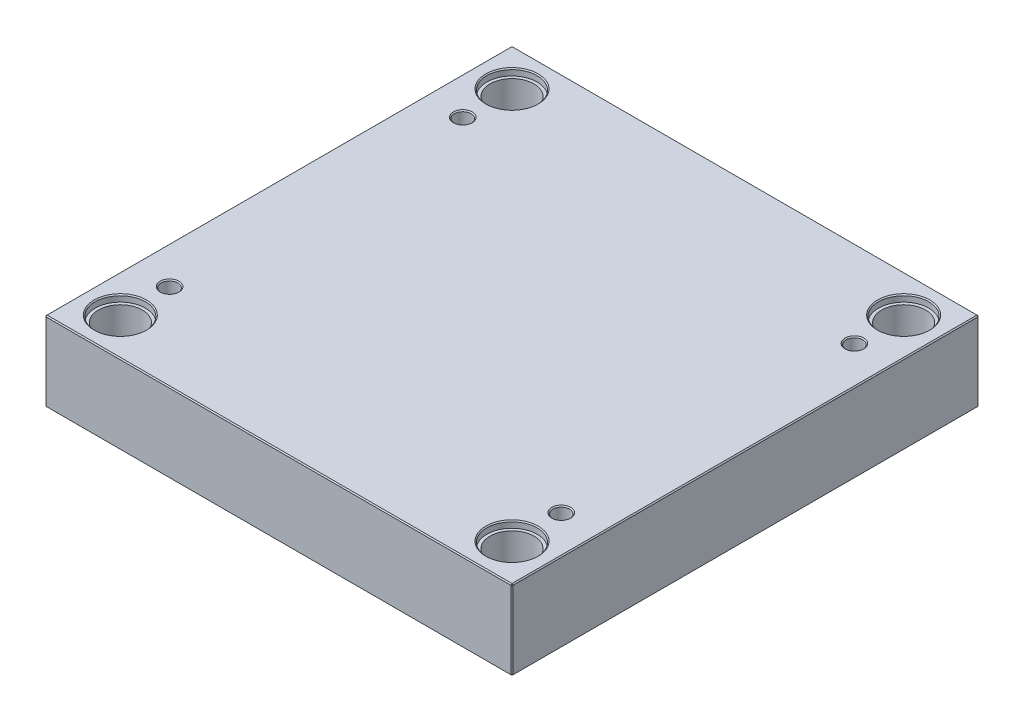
ISO-10303-21;
HEADER;
FILE_DESCRIPTION(('STEP AP214'),'2;1');
FILE_NAME('part.step','',(''),(''),'','','');
FILE_SCHEMA(('AUTOMOTIVE_DESIGN { 1 0 10303 214 1 1 1 1 }'));
ENDSEC;
DATA;
#1=APPLICATION_CONTEXT('core data for automotive mechanical design processes');
#2=APPLICATION_PROTOCOL_DEFINITION('international standard','automotive_design',2000,#1);
#3=PRODUCT_CONTEXT('',#1,'mechanical');
#4=PRODUCT('Part','Part','',(#3));
#5=PRODUCT_RELATED_PRODUCT_CATEGORY('part','',(#4));
#6=PRODUCT_DEFINITION_FORMATION('','',#4);
#7=PRODUCT_DEFINITION_CONTEXT('part definition',#1,'design');
#8=PRODUCT_DEFINITION('design','',#6,#7);
#9=PRODUCT_DEFINITION_SHAPE('','',#8);
#10=(LENGTH_UNIT() NAMED_UNIT(*) SI_UNIT(.MILLI.,.METRE.));
#11=(NAMED_UNIT(*) PLANE_ANGLE_UNIT() SI_UNIT($,.RADIAN.));
#12=(NAMED_UNIT(*) SI_UNIT($,.STERADIAN.) SOLID_ANGLE_UNIT());
#13=UNCERTAINTY_MEASURE_WITH_UNIT(LENGTH_MEASURE(1.E-05),#10,'distance_accuracy_value','');
#14=(GEOMETRIC_REPRESENTATION_CONTEXT(3) GLOBAL_UNCERTAINTY_ASSIGNED_CONTEXT((#13)) GLOBAL_UNIT_ASSIGNED_CONTEXT((#10,
#11,#12)) REPRESENTATION_CONTEXT('',''));
#15=CARTESIAN_POINT('',(0.,0.,0.));
#16=DIRECTION('',(0.,0.,1.));
#17=DIRECTION('',(1.,0.,0.));
#18=AXIS2_PLACEMENT_3D('',#15,#16,#17);
#19=CARTESIAN_POINT('',(-187.,0.,-187.));
#20=DIRECTION('',(0.,1.,0.));
#21=DIRECTION('',(0.,0.,1.));
#22=AXIS2_PLACEMENT_3D('',#19,#20,#21);
#23=CYLINDRICAL_SURFACE('',#22,21.);
#24=CARTESIAN_POINT('',(-187.,1.00000000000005,-187.));
#25=DIRECTION('',(0.,1.,0.));
#26=DIRECTION('',(0.,0.,1.));
#27=AXIS2_PLACEMENT_3D('',#24,#25,#26);
#28=CIRCLE('',#27,21.);
#29=CARTESIAN_POINT('',(-187.,1.00000000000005,-166.));
#30=VERTEX_POINT('',#29);
#31=EDGE_CURVE('E472',#30,#30,#28,.F.);
#32=ORIENTED_EDGE('',*,*,#31,.T.);
#33=EDGE_LOOP('',(#32));
#34=FACE_BOUND('',#33,.T.);
#35=CARTESIAN_POINT('',(-187.,69.7,-187.));
#36=DIRECTION('',(0.,1.,0.));
#37=DIRECTION('',(0.,0.,1.));
#38=AXIS2_PLACEMENT_3D('',#35,#36,#37);
#39=CIRCLE('',#38,21.);
#40=CARTESIAN_POINT('',(-187.,69.7,-166.));
#41=VERTEX_POINT('',#40);
#42=EDGE_CURVE('E221',#41,#41,#39,.F.);
#43=ORIENTED_EDGE('',*,*,#42,.F.);
#44=EDGE_LOOP('',(#43));
#45=FACE_BOUND('',#44,.T.);
#46=ADVANCED_FACE('F16',(#34,#45),#23,.F.);
#47=CARTESIAN_POINT('',(187.,0.,-187.));
#48=DIRECTION('',(0.,1.,0.));
#49=DIRECTION('',(0.,0.,1.));
#50=AXIS2_PLACEMENT_3D('',#47,#48,#49);
#51=CYLINDRICAL_SURFACE('',#50,21.);
#52=CARTESIAN_POINT('',(187.,1.00000000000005,-187.));
#53=DIRECTION('',(0.,1.,0.));
#54=DIRECTION('',(0.,0.,1.));
#55=AXIS2_PLACEMENT_3D('',#52,#53,#54);
#56=CIRCLE('',#55,21.);
#57=CARTESIAN_POINT('',(187.,1.00000000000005,-166.));
#58=VERTEX_POINT('',#57);
#59=EDGE_CURVE('E474',#58,#58,#56,.F.);
#60=ORIENTED_EDGE('',*,*,#59,.T.);
#61=EDGE_LOOP('',(#60));
#62=FACE_BOUND('',#61,.T.);
#63=CARTESIAN_POINT('',(187.,69.7,-187.));
#64=DIRECTION('',(0.,1.,0.));
#65=DIRECTION('',(0.,0.,1.));
#66=AXIS2_PLACEMENT_3D('',#63,#64,#65);
#67=CIRCLE('',#66,21.);
#68=CARTESIAN_POINT('',(187.,69.7,-166.));
#69=VERTEX_POINT('',#68);
#70=EDGE_CURVE('E218',#69,#69,#67,.F.);
#71=ORIENTED_EDGE('',*,*,#70,.F.);
#72=EDGE_LOOP('',(#71));
#73=FACE_BOUND('',#72,.T.);
#74=ADVANCED_FACE('F263',(#62,#73),#51,.F.);
#75=CARTESIAN_POINT('',(187.,0.,187.));
#76=DIRECTION('',(0.,1.,0.));
#77=DIRECTION('',(0.,0.,1.));
#78=AXIS2_PLACEMENT_3D('',#75,#76,#77);
#79=CYLINDRICAL_SURFACE('',#78,21.);
#80=CARTESIAN_POINT('',(187.,0.999999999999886,187.));
#81=DIRECTION('',(0.,1.,0.));
#82=DIRECTION('',(0.,0.,1.));
#83=AXIS2_PLACEMENT_3D('',#80,#81,#82);
#84=CIRCLE('',#83,21.);
#85=CARTESIAN_POINT('',(187.,0.999999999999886,208.));
#86=VERTEX_POINT('',#85);
#87=EDGE_CURVE('E477',#86,#86,#84,.F.);
#88=ORIENTED_EDGE('',*,*,#87,.T.);
#89=EDGE_LOOP('',(#88));
#90=FACE_BOUND('',#89,.T.);
#91=CARTESIAN_POINT('',(187.,69.7,187.));
#92=DIRECTION('',(0.,1.,0.));
#93=DIRECTION('',(0.,0.,1.));
#94=AXIS2_PLACEMENT_3D('',#91,#92,#93);
#95=CIRCLE('',#94,21.);
#96=CARTESIAN_POINT('',(187.,69.7,208.));
#97=VERTEX_POINT('',#96);
#98=EDGE_CURVE('E214',#97,#97,#95,.F.);
#99=ORIENTED_EDGE('',*,*,#98,.F.);
#100=EDGE_LOOP('',(#99));
#101=FACE_BOUND('',#100,.T.);
#102=ADVANCED_FACE('F270',(#90,#101),#79,.F.);
#103=CARTESIAN_POINT('',(-187.,0.,187.));
#104=DIRECTION('',(0.,1.,0.));
#105=DIRECTION('',(0.,0.,1.));
#106=AXIS2_PLACEMENT_3D('',#103,#104,#105);
#107=CYLINDRICAL_SURFACE('',#106,21.);
#108=CARTESIAN_POINT('',(-187.,0.999999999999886,187.));
#109=DIRECTION('',(0.,1.,0.));
#110=DIRECTION('',(0.,0.,1.));
#111=AXIS2_PLACEMENT_3D('',#108,#109,#110);
#112=CIRCLE('',#111,21.);
#113=CARTESIAN_POINT('',(-187.,0.999999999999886,208.));
#114=VERTEX_POINT('',#113);
#115=EDGE_CURVE('E480',#114,#114,#112,.F.);
#116=ORIENTED_EDGE('',*,*,#115,.T.);
#117=EDGE_LOOP('',(#116));
#118=FACE_BOUND('',#117,.T.);
#119=CARTESIAN_POINT('',(-187.,69.7,187.));
#120=DIRECTION('',(0.,1.,0.));
#121=DIRECTION('',(0.,0.,1.));
#122=AXIS2_PLACEMENT_3D('',#119,#120,#121);
#123=CIRCLE('',#122,21.);
#124=CARTESIAN_POINT('',(-187.,69.7,208.));
#125=VERTEX_POINT('',#124);
#126=EDGE_CURVE('E211',#125,#125,#123,.F.);
#127=ORIENTED_EDGE('',*,*,#126,.F.);
#128=EDGE_LOOP('',(#127));
#129=FACE_BOUND('',#128,.T.);
#130=ADVANCED_FACE('F277',(#118,#129),#107,.F.);
#131=CARTESIAN_POINT('',(-223.,76.,223.));
#132=DIRECTION('',(1.,0.,0.));
#133=DIRECTION('',(0.,0.,-1.));
#134=AXIS2_PLACEMENT_3D('',#131,#132,#133);
#135=PLANE('',#134);
#136=DIRECTION('',(0.,-1.,0.));
#137=VECTOR('',#136,1.);
#138=CARTESIAN_POINT('',(-223.,76.,-222.));
#139=LINE('',#138,#137);
#140=CARTESIAN_POINT('',(-223.,75.,-222.));
#141=VERTEX_POINT('',#140);
#142=CARTESIAN_POINT('',(-223.,1.,-222.));
#143=VERTEX_POINT('',#142);
#144=EDGE_CURVE('E487',#141,#143,#139,.T.);
#145=ORIENTED_EDGE('',*,*,#144,.T.);
#146=DIRECTION('',(0.,0.,1.));
#147=VECTOR('',#146,1.);
#148=CARTESIAN_POINT('',(-223.,1.,223.));
#149=LINE('',#148,#147);
#150=CARTESIAN_POINT('',(-223.,1.,222.));
#151=VERTEX_POINT('',#150);
#152=EDGE_CURVE('E490',#143,#151,#149,.T.);
#153=ORIENTED_EDGE('',*,*,#152,.T.);
#154=DIRECTION('',(0.,1.,0.));
#155=VECTOR('',#154,1.);
#156=CARTESIAN_POINT('',(-223.,76.,222.));
#157=LINE('',#156,#155);
#158=CARTESIAN_POINT('',(-223.,75.,222.));
#159=VERTEX_POINT('',#158);
#160=EDGE_CURVE('E485',#151,#159,#157,.T.);
#161=ORIENTED_EDGE('',*,*,#160,.T.);
#162=DIRECTION('',(0.,0.,-1.));
#163=VECTOR('',#162,1.);
#164=CARTESIAN_POINT('',(-223.,75.,-223.));
#165=LINE('',#164,#163);
#166=EDGE_CURVE('E483',#159,#141,#165,.T.);
#167=ORIENTED_EDGE('',*,*,#166,.T.);
#168=EDGE_LOOP('',(#145,#153,#161,#167));
#169=FACE_BOUND('',#168,.T.);
#170=ADVANCED_FACE('F298',(#169),#135,.F.);
#171=CARTESIAN_POINT('',(223.,76.,223.));
#172=DIRECTION('',(0.,0.,-1.));
#173=DIRECTION('',(-1.,0.,0.));
#174=AXIS2_PLACEMENT_3D('',#171,#172,#173);
#175=PLANE('',#174);
#176=DIRECTION('',(-1.,0.,0.));
#177=VECTOR('',#176,1.);
#178=CARTESIAN_POINT('',(-223.,75.,223.));
#179=LINE('',#178,#177);
#180=CARTESIAN_POINT('',(222.,75.,223.));
#181=VERTEX_POINT('',#180);
#182=CARTESIAN_POINT('',(-222.,75.,223.));
#183=VERTEX_POINT('',#182);
#184=EDGE_CURVE('E509',#181,#183,#179,.T.);
#185=ORIENTED_EDGE('',*,*,#184,.T.);
#186=DIRECTION('',(0.,-1.,0.));
#187=VECTOR('',#186,1.);
#188=CARTESIAN_POINT('',(-222.,76.,223.));
#189=LINE('',#188,#187);
#190=CARTESIAN_POINT('',(-222.,1.00000000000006,223.));
#191=VERTEX_POINT('',#190);
#192=EDGE_CURVE('E515',#183,#191,#189,.T.);
#193=ORIENTED_EDGE('',*,*,#192,.T.);
#194=DIRECTION('',(1.,0.,0.));
#195=VECTOR('',#194,1.);
#196=CARTESIAN_POINT('',(223.,1.00000000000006,223.));
#197=LINE('',#196,#195);
#198=CARTESIAN_POINT('',(222.,1.00000000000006,223.));
#199=VERTEX_POINT('',#198);
#200=EDGE_CURVE('E513',#191,#199,#197,.T.);
#201=ORIENTED_EDGE('',*,*,#200,.T.);
#202=DIRECTION('',(0.,1.,0.));
#203=VECTOR('',#202,1.);
#204=CARTESIAN_POINT('',(222.,76.,223.));
#205=LINE('',#204,#203);
#206=EDGE_CURVE('E511',#199,#181,#205,.T.);
#207=ORIENTED_EDGE('',*,*,#206,.T.);
#208=EDGE_LOOP('',(#185,#193,#201,#207));
#209=FACE_BOUND('',#208,.T.);
#210=ADVANCED_FACE('F294',(#209),#175,.F.);
#211=CARTESIAN_POINT('',(223.,76.,223.));
#212=DIRECTION('',(-1.,0.,0.));
#213=DIRECTION('',(0.,0.,1.));
#214=AXIS2_PLACEMENT_3D('',#211,#212,#213);
#215=PLANE('',#214);
#216=DIRECTION('',(0.,0.,-1.));
#217=VECTOR('',#216,1.);
#218=CARTESIAN_POINT('',(223.,1.00000000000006,223.));
#219=LINE('',#218,#217);
#220=CARTESIAN_POINT('',(223.,1.00000000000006,222.));
#221=VERTEX_POINT('',#220);
#222=CARTESIAN_POINT('',(223.,1.00000000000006,-222.));
#223=VERTEX_POINT('',#222);
#224=EDGE_CURVE('E504',#221,#223,#219,.T.);
#225=ORIENTED_EDGE('',*,*,#224,.T.);
#226=DIRECTION('',(0.,1.,0.));
#227=VECTOR('',#226,1.);
#228=CARTESIAN_POINT('',(223.,76.,-222.));
#229=LINE('',#228,#227);
#230=CARTESIAN_POINT('',(223.,75.,-222.));
#231=VERTEX_POINT('',#230);
#232=EDGE_CURVE('E506',#223,#231,#229,.T.);
#233=ORIENTED_EDGE('',*,*,#232,.T.);
#234=DIRECTION('',(0.,0.,1.));
#235=VECTOR('',#234,1.);
#236=CARTESIAN_POINT('',(223.,75.,223.));
#237=LINE('',#236,#235);
#238=CARTESIAN_POINT('',(223.,75.,222.));
#239=VERTEX_POINT('',#238);
#240=EDGE_CURVE('E500',#231,#239,#237,.T.);
#241=ORIENTED_EDGE('',*,*,#240,.T.);
#242=DIRECTION('',(0.,-1.,0.));
#243=VECTOR('',#242,1.);
#244=CARTESIAN_POINT('',(223.,76.,222.));
#245=LINE('',#244,#243);
#246=EDGE_CURVE('E502',#239,#221,#245,.T.);
#247=ORIENTED_EDGE('',*,*,#246,.T.);
#248=EDGE_LOOP('',(#225,#233,#241,#247));
#249=FACE_BOUND('',#248,.T.);
#250=ADVANCED_FACE('F290',(#249),#215,.F.);
#251=CARTESIAN_POINT('',(223.,76.,-223.));
#252=DIRECTION('',(0.,0.,1.));
#253=DIRECTION('',(1.,0.,0.));
#254=AXIS2_PLACEMENT_3D('',#251,#252,#253);
#255=PLANE('',#254);
#256=DIRECTION('',(0.,-1.,0.));
#257=VECTOR('',#256,1.);
#258=CARTESIAN_POINT('',(222.,76.,-223.));
#259=LINE('',#258,#257);
#260=CARTESIAN_POINT('',(222.,75.,-223.));
#261=VERTEX_POINT('',#260);
#262=CARTESIAN_POINT('',(222.,1.00000000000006,-223.));
#263=VERTEX_POINT('',#262);
#264=EDGE_CURVE('E494',#261,#263,#259,.T.);
#265=ORIENTED_EDGE('',*,*,#264,.T.);
#266=DIRECTION('',(-1.,0.,0.));
#267=VECTOR('',#266,1.);
#268=CARTESIAN_POINT('',(223.,1.00000000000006,-223.));
#269=LINE('',#268,#267);
#270=CARTESIAN_POINT('',(-222.,1.00000000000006,-223.));
#271=VERTEX_POINT('',#270);
#272=EDGE_CURVE('E138',#263,#271,#269,.T.);
#273=ORIENTED_EDGE('',*,*,#272,.T.);
#274=DIRECTION('',(0.,1.,0.));
#275=VECTOR('',#274,1.);
#276=CARTESIAN_POINT('',(-222.,76.,-223.));
#277=LINE('',#276,#275);
#278=CARTESIAN_POINT('',(-222.,75.,-223.));
#279=VERTEX_POINT('',#278);
#280=EDGE_CURVE('E496',#271,#279,#277,.T.);
#281=ORIENTED_EDGE('',*,*,#280,.T.);
#282=DIRECTION('',(1.,0.,0.));
#283=VECTOR('',#282,1.);
#284=CARTESIAN_POINT('',(223.,75.,-223.));
#285=LINE('',#284,#283);
#286=EDGE_CURVE('E492',#279,#261,#285,.T.);
#287=ORIENTED_EDGE('',*,*,#286,.T.);
#288=EDGE_LOOP('',(#265,#273,#281,#287));
#289=FACE_BOUND('',#288,.T.);
#290=ADVANCED_FACE('F282',(#289),#255,.F.);
#291=CARTESIAN_POINT('',(0.,76.,0.));
#292=DIRECTION('',(0.,1.,0.));
#293=DIRECTION('',(0.,0.,1.));
#294=AXIS2_PLACEMENT_3D('',#291,#292,#293);
#295=PLANE('',#294);
#296=CARTESIAN_POINT('',(187.,76.,187.));
#297=DIRECTION('',(0.,1.,0.));
#298=DIRECTION('',(0.,0.,1.));
#299=AXIS2_PLACEMENT_3D('',#296,#297,#298);
#300=CIRCLE('',#299,25.);
#301=CARTESIAN_POINT('',(187.,76.,212.));
#302=VERTEX_POINT('',#301);
#303=EDGE_CURVE('E236',#302,#302,#300,.F.);
#304=ORIENTED_EDGE('',*,*,#303,.T.);
#305=EDGE_LOOP('',(#304));
#306=FACE_BOUND('',#305,.T.);
#307=CARTESIAN_POINT('',(-187.,76.,187.));
#308=DIRECTION('',(0.,1.,0.));
#309=DIRECTION('',(0.,0.,1.));
#310=AXIS2_PLACEMENT_3D('',#307,#308,#309);
#311=CIRCLE('',#310,25.);
#312=CARTESIAN_POINT('',(-187.,76.,212.));
#313=VERTEX_POINT('',#312);
#314=EDGE_CURVE('E233',#313,#313,#311,.F.);
#315=ORIENTED_EDGE('',*,*,#314,.T.);
#316=EDGE_LOOP('',(#315));
#317=FACE_BOUND('',#316,.T.);
#318=CARTESIAN_POINT('',(187.,76.,-187.));
#319=DIRECTION('',(0.,1.,0.));
#320=DIRECTION('',(0.,0.,1.));
#321=AXIS2_PLACEMENT_3D('',#318,#319,#320);
#322=CIRCLE('',#321,25.);
#323=CARTESIAN_POINT('',(187.,76.,-162.));
#324=VERTEX_POINT('',#323);
#325=EDGE_CURVE('E230',#324,#324,#322,.F.);
#326=ORIENTED_EDGE('',*,*,#325,.T.);
#327=EDGE_LOOP('',(#326));
#328=FACE_BOUND('',#327,.T.);
#329=CARTESIAN_POINT('',(-187.,76.,-187.));
#330=DIRECTION('',(0.,1.,0.));
#331=DIRECTION('',(0.,0.,1.));
#332=AXIS2_PLACEMENT_3D('',#329,#330,#331);
#333=CIRCLE('',#332,25.);
#334=CARTESIAN_POINT('',(-187.,76.,-162.));
#335=VERTEX_POINT('',#334);
#336=EDGE_CURVE('E227',#335,#335,#333,.F.);
#337=ORIENTED_EDGE('',*,*,#336,.T.);
#338=EDGE_LOOP('',(#337));
#339=FACE_BOUND('',#338,.T.);
#340=CARTESIAN_POINT('',(-187.,76.,140.));
#341=DIRECTION('',(0.,1.,0.));
#342=DIRECTION('',(0.,0.,1.));
#343=AXIS2_PLACEMENT_3D('',#340,#341,#342);
#344=CIRCLE('',#343,9.);
#345=CARTESIAN_POINT('',(-187.,76.,149.));
#346=VERTEX_POINT('',#345);
#347=EDGE_CURVE('E198',#346,#346,#344,.F.);
#348=ORIENTED_EDGE('',*,*,#347,.T.);
#349=EDGE_LOOP('',(#348));
#350=FACE_BOUND('',#349,.T.);
#351=CARTESIAN_POINT('',(187.,76.,140.));
#352=DIRECTION('',(0.,1.,0.));
#353=DIRECTION('',(0.,0.,1.));
#354=AXIS2_PLACEMENT_3D('',#351,#352,#353);
#355=CIRCLE('',#354,9.);
#356=CARTESIAN_POINT('',(187.,76.,149.));
#357=VERTEX_POINT('',#356);
#358=EDGE_CURVE('E195',#357,#357,#355,.F.);
#359=ORIENTED_EDGE('',*,*,#358,.T.);
#360=EDGE_LOOP('',(#359));
#361=FACE_BOUND('',#360,.T.);
#362=CARTESIAN_POINT('',(187.,76.,-140.));
#363=DIRECTION('',(0.,1.,0.));
#364=DIRECTION('',(0.,0.,1.));
#365=AXIS2_PLACEMENT_3D('',#362,#363,#364);
#366=CIRCLE('',#365,9.);
#367=CARTESIAN_POINT('',(187.,76.,-131.));
#368=VERTEX_POINT('',#367);
#369=EDGE_CURVE('E192',#368,#368,#366,.F.);
#370=ORIENTED_EDGE('',*,*,#369,.T.);
#371=EDGE_LOOP('',(#370));
#372=FACE_BOUND('',#371,.T.);
#373=CARTESIAN_POINT('',(-187.,76.,-140.));
#374=DIRECTION('',(0.,1.,0.));
#375=DIRECTION('',(0.,0.,1.));
#376=AXIS2_PLACEMENT_3D('',#373,#374,#375);
#377=CIRCLE('',#376,8.9999999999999);
#378=CARTESIAN_POINT('',(-187.,76.,-131.));
#379=VERTEX_POINT('',#378);
#380=EDGE_CURVE('E188',#379,#379,#377,.F.);
#381=ORIENTED_EDGE('',*,*,#380,.T.);
#382=EDGE_LOOP('',(#381));
#383=FACE_BOUND('',#382,.T.);
#384=DIRECTION('',(0.,0.,-1.));
#385=VECTOR('',#384,1.);
#386=CARTESIAN_POINT('',(222.,76.,-223.));
#387=LINE('',#386,#385);
#388=CARTESIAN_POINT('',(222.,76.,222.));
#389=VERTEX_POINT('',#388);
#390=CARTESIAN_POINT('',(222.,76.,-222.));
#391=VERTEX_POINT('',#390);
#392=EDGE_CURVE('E31',#389,#391,#387,.T.);
#393=ORIENTED_EDGE('',*,*,#392,.T.);
#394=DIRECTION('',(-1.,0.,0.));
#395=VECTOR('',#394,1.);
#396=CARTESIAN_POINT('',(-223.,76.,-222.));
#397=LINE('',#396,#395);
#398=CARTESIAN_POINT('',(-222.,76.,-222.));
#399=VERTEX_POINT('',#398);
#400=EDGE_CURVE('E189',#391,#399,#397,.T.);
#401=ORIENTED_EDGE('',*,*,#400,.T.);
#402=DIRECTION('',(0.,0.,1.));
#403=VECTOR('',#402,1.);
#404=CARTESIAN_POINT('',(-222.,76.,223.));
#405=LINE('',#404,#403);
#406=CARTESIAN_POINT('',(-222.,76.,222.));
#407=VERTEX_POINT('',#406);
#408=EDGE_CURVE('E518',#399,#407,#405,.T.);
#409=ORIENTED_EDGE('',*,*,#408,.T.);
#410=DIRECTION('',(1.,0.,0.));
#411=VECTOR('',#410,1.);
#412=CARTESIAN_POINT('',(223.,76.,222.));
#413=LINE('',#412,#411);
#414=EDGE_CURVE('E36',#407,#389,#413,.T.);
#415=ORIENTED_EDGE('',*,*,#414,.T.);
#416=EDGE_LOOP('',(#393,#401,#409,#415));
#417=FACE_BOUND('',#416,.T.);
#418=ADVANCED_FACE('F279',(#306,#317,#328,#339,#350,#361,#372,#383,#417),#295,.T.);
#419=CARTESIAN_POINT('',(0.,0.,0.));
#420=DIRECTION('',(0.,1.,0.));
#421=DIRECTION('',(0.,0.,1.));
#422=AXIS2_PLACEMENT_3D('',#419,#420,#421);
#423=PLANE('',#422);
#424=CARTESIAN_POINT('',(-187.,0.,-187.));
#425=DIRECTION('',(0.,1.,0.));
#426=DIRECTION('',(0.,0.,1.));
#427=AXIS2_PLACEMENT_3D('',#424,#425,#426);
#428=CIRCLE('',#427,22.);
#429=CARTESIAN_POINT('',(-187.,0.,-165.));
#430=VERTEX_POINT('',#429);
#431=EDGE_CURVE('E469',#430,#430,#428,.T.);
#432=ORIENTED_EDGE('',*,*,#431,.T.);
#433=EDGE_LOOP('',(#432));
#434=FACE_BOUND('',#433,.T.);
#435=CARTESIAN_POINT('',(187.,0.,-187.));
#436=DIRECTION('',(0.,1.,0.));
#437=DIRECTION('',(0.,0.,1.));
#438=AXIS2_PLACEMENT_3D('',#435,#436,#437);
#439=CIRCLE('',#438,22.);
#440=CARTESIAN_POINT('',(187.,0.,-165.));
#441=VERTEX_POINT('',#440);
#442=EDGE_CURVE('E466',#441,#441,#439,.T.);
#443=ORIENTED_EDGE('',*,*,#442,.T.);
#444=EDGE_LOOP('',(#443));
#445=FACE_BOUND('',#444,.T.);
#446=CARTESIAN_POINT('',(187.,0.,187.));
#447=DIRECTION('',(0.,1.,0.));
#448=DIRECTION('',(0.,0.,1.));
#449=AXIS2_PLACEMENT_3D('',#446,#447,#448);
#450=CIRCLE('',#449,22.);
#451=CARTESIAN_POINT('',(187.,0.,209.));
#452=VERTEX_POINT('',#451);
#453=EDGE_CURVE('E463',#452,#452,#450,.T.);
#454=ORIENTED_EDGE('',*,*,#453,.T.);
#455=EDGE_LOOP('',(#454));
#456=FACE_BOUND('',#455,.T.);
#457=CARTESIAN_POINT('',(-187.,0.,187.));
#458=DIRECTION('',(0.,1.,0.));
#459=DIRECTION('',(0.,0.,1.));
#460=AXIS2_PLACEMENT_3D('',#457,#458,#459);
#461=CIRCLE('',#460,22.);
#462=CARTESIAN_POINT('',(-187.,0.,209.));
#463=VERTEX_POINT('',#462);
#464=EDGE_CURVE('E460',#463,#463,#461,.T.);
#465=ORIENTED_EDGE('',*,*,#464,.T.);
#466=EDGE_LOOP('',(#465));
#467=FACE_BOUND('',#466,.T.);
#468=DIRECTION('',(0.,0.,1.));
#469=VECTOR('',#468,1.);
#470=CARTESIAN_POINT('',(222.,0.,0.));
#471=LINE('',#470,#469);
#472=CARTESIAN_POINT('',(222.,0.,-222.));
#473=VERTEX_POINT('',#472);
#474=CARTESIAN_POINT('',(222.,0.,222.));
#475=VERTEX_POINT('',#474);
#476=EDGE_CURVE('E108',#473,#475,#471,.T.);
#477=ORIENTED_EDGE('',*,*,#476,.T.);
#478=DIRECTION('',(-1.,0.,0.));
#479=VECTOR('',#478,1.);
#480=CARTESIAN_POINT('',(0.,0.,222.));
#481=LINE('',#480,#479);
#482=CARTESIAN_POINT('',(-222.,0.,222.));
#483=VERTEX_POINT('',#482);
#484=EDGE_CURVE('E458',#475,#483,#481,.T.);
#485=ORIENTED_EDGE('',*,*,#484,.T.);
#486=DIRECTION('',(0.,0.,-1.));
#487=VECTOR('',#486,1.);
#488=CARTESIAN_POINT('',(-222.,0.,0.));
#489=LINE('',#488,#487);
#490=CARTESIAN_POINT('',(-222.,0.,-222.));
#491=VERTEX_POINT('',#490);
#492=EDGE_CURVE('E110',#483,#491,#489,.T.);
#493=ORIENTED_EDGE('',*,*,#492,.T.);
#494=DIRECTION('',(1.,0.,0.));
#495=VECTOR('',#494,1.);
#496=CARTESIAN_POINT('',(0.,0.,-222.));
#497=LINE('',#496,#495);
#498=EDGE_CURVE('E104',#491,#473,#497,.T.);
#499=ORIENTED_EDGE('',*,*,#498,.T.);
#500=EDGE_LOOP('',(#477,#485,#493,#499));
#501=FACE_BOUND('',#500,.T.);
#502=ADVANCED_FACE('F106',(#434,#445,#456,#467,#501),#423,.F.);
#503=CARTESIAN_POINT('',(-187.,0.,-187.));
#504=DIRECTION('',(0.,-1.,0.));
#505=DIRECTION('',(0.,0.,-1.));
#506=AXIS2_PLACEMENT_3D('',#503,#504,#505);
#507=CONICAL_SURFACE('',#506,22.,0.785398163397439);
#508=ORIENTED_EDGE('',*,*,#31,.F.);
#509=EDGE_LOOP('',(#508));
#510=FACE_BOUND('',#509,.T.);
#511=ORIENTED_EDGE('',*,*,#431,.F.);
#512=EDGE_LOOP('',(#511));
#513=FACE_BOUND('',#512,.T.);
#514=ADVANCED_FACE('F286',(#510,#513),#507,.F.);
#515=CARTESIAN_POINT('',(187.,0.,-187.));
#516=DIRECTION('',(0.,-1.,0.));
#517=DIRECTION('',(0.,0.,-1.));
#518=AXIS2_PLACEMENT_3D('',#515,#516,#517);
#519=CONICAL_SURFACE('',#518,22.,0.785398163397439);
#520=ORIENTED_EDGE('',*,*,#59,.F.);
#521=EDGE_LOOP('',(#520));
#522=FACE_BOUND('',#521,.T.);
#523=ORIENTED_EDGE('',*,*,#442,.F.);
#524=EDGE_LOOP('',(#523));
#525=FACE_BOUND('',#524,.T.);
#526=ADVANCED_FACE('F305',(#522,#525),#519,.F.);
#527=CARTESIAN_POINT('',(187.,0.,187.));
#528=DIRECTION('',(0.,-1.,0.));
#529=DIRECTION('',(0.,0.,-1.));
#530=AXIS2_PLACEMENT_3D('',#527,#528,#529);
#531=CONICAL_SURFACE('',#530,22.,0.78539816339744);
#532=ORIENTED_EDGE('',*,*,#87,.F.);
#533=EDGE_LOOP('',(#532));
#534=FACE_BOUND('',#533,.T.);
#535=ORIENTED_EDGE('',*,*,#453,.F.);
#536=EDGE_LOOP('',(#535));
#537=FACE_BOUND('',#536,.T.);
#538=ADVANCED_FACE('F309',(#534,#537),#531,.F.);
#539=CARTESIAN_POINT('',(-187.,0.,187.));
#540=DIRECTION('',(0.,-1.,0.));
#541=DIRECTION('',(0.,0.,-1.));
#542=AXIS2_PLACEMENT_3D('',#539,#540,#541);
#543=CONICAL_SURFACE('',#542,22.,0.78539816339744);
#544=ORIENTED_EDGE('',*,*,#115,.F.);
#545=EDGE_LOOP('',(#544));
#546=FACE_BOUND('',#545,.T.);
#547=ORIENTED_EDGE('',*,*,#464,.F.);
#548=EDGE_LOOP('',(#547));
#549=FACE_BOUND('',#548,.T.);
#550=ADVANCED_FACE('F313',(#546,#549),#543,.F.);
#551=CARTESIAN_POINT('',(223.,76.,222.));
#552=DIRECTION('',(-0.707106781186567,0.,-0.707106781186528));
#553=DIRECTION('',(0.,-1.,0.));
#554=AXIS2_PLACEMENT_3D('',#551,#552,#553);
#555=PLANE('',#554);
#556=DIRECTION('',(-0.707106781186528,0.,0.707106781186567));
#557=VECTOR('',#556,1.);
#558=CARTESIAN_POINT('',(222.,75.,223.));
#559=LINE('',#558,#557);
#560=EDGE_CURVE('E126',#181,#239,#559,.F.);
#561=ORIENTED_EDGE('',*,*,#560,.F.);
#562=ORIENTED_EDGE('',*,*,#206,.F.);
#563=DIRECTION('',(0.707106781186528,0.,-0.707106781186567));
#564=VECTOR('',#563,1.);
#565=CARTESIAN_POINT('',(222.,1.00000000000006,223.));
#566=LINE('',#565,#564);
#567=EDGE_CURVE('E180',#221,#199,#566,.F.);
#568=ORIENTED_EDGE('',*,*,#567,.F.);
#569=ORIENTED_EDGE('',*,*,#246,.F.);
#570=EDGE_LOOP('',(#561,#562,#568,#569));
#571=FACE_BOUND('',#570,.T.);
#572=ADVANCED_FACE('F317',(#571),#555,.F.);
#573=CARTESIAN_POINT('',(222.,75.,223.));
#574=DIRECTION('',(0.577350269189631,0.577350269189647,0.577350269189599));
#575=DIRECTION('',(-0.707106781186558,0.707106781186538,0.));
#576=AXIS2_PLACEMENT_3D('',#573,#574,#575);
#577=PLANE('',#576);
#578=DIRECTION('',(0.,-0.707106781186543,0.707106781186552));
#579=VECTOR('',#578,1.);
#580=CARTESIAN_POINT('',(222.,75.,223.));
#581=LINE('',#580,#579);
#582=EDGE_CURVE('E175',#181,#389,#581,.F.);
#583=ORIENTED_EDGE('',*,*,#582,.F.);
#584=ORIENTED_EDGE('',*,*,#560,.T.);
#585=DIRECTION('',(-0.707106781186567,0.707106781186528,0.));
#586=VECTOR('',#585,1.);
#587=CARTESIAN_POINT('',(222.5,75.5,222.));
#588=LINE('',#587,#586);
#589=EDGE_CURVE('E177',#389,#239,#588,.F.);
#590=ORIENTED_EDGE('',*,*,#589,.F.);
#591=EDGE_LOOP('',(#583,#584,#590));
#592=FACE_BOUND('',#591,.T.);
#593=ADVANCED_FACE('F385',(#592),#577,.T.);
#594=CARTESIAN_POINT('',(222.,1.00000000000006,223.));
#595=DIRECTION('',(0.577350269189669,-0.577350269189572,0.577350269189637));
#596=DIRECTION('',(0.707106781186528,0.,-0.707106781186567));
#597=AXIS2_PLACEMENT_3D('',#594,#595,#596);
#598=PLANE('',#597);
#599=DIRECTION('',(-0.707106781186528,-0.707106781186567,0.));
#600=VECTOR('',#599,1.);
#601=CARTESIAN_POINT('',(222.5,0.5,222.));
#602=LINE('',#601,#600);
#603=EDGE_CURVE('E124',#221,#475,#602,.T.);
#604=ORIENTED_EDGE('',*,*,#603,.F.);
#605=ORIENTED_EDGE('',*,*,#567,.T.);
#606=DIRECTION('',(0.,0.707106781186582,0.707106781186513));
#607=VECTOR('',#606,1.);
#608=CARTESIAN_POINT('',(222.,1.00000000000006,223.));
#609=LINE('',#608,#607);
#610=EDGE_CURVE('E172',#475,#199,#609,.T.);
#611=ORIENTED_EDGE('',*,*,#610,.F.);
#612=EDGE_LOOP('',(#604,#605,#611));
#613=FACE_BOUND('',#612,.T.);
#614=ADVANCED_FACE('F381',(#613),#598,.T.);
#615=CARTESIAN_POINT('',(222.,76.,0.));
#616=DIRECTION('',(0.707106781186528,0.707106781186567,0.));
#617=DIRECTION('',(0.,0.,1.));
#618=AXIS2_PLACEMENT_3D('',#615,#616,#617);
#619=PLANE('',#618);
#620=ORIENTED_EDGE('',*,*,#589,.T.);
#621=ORIENTED_EDGE('',*,*,#240,.F.);
#622=DIRECTION('',(0.707106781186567,-0.707106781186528,0.));
#623=VECTOR('',#622,1.);
#624=CARTESIAN_POINT('',(223.,75.,-222.));
#625=LINE('',#624,#623);
#626=EDGE_CURVE('E166',#391,#231,#625,.T.);
#627=ORIENTED_EDGE('',*,*,#626,.F.);
#628=ORIENTED_EDGE('',*,*,#392,.F.);
#629=EDGE_LOOP('',(#620,#621,#627,#628));
#630=FACE_BOUND('',#629,.T.);
#631=ADVANCED_FACE('F377',(#630),#619,.T.);
#632=CARTESIAN_POINT('',(0.,76.,222.));
#633=DIRECTION('',(0.,0.707106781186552,0.707106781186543));
#634=DIRECTION('',(-1.,0.,0.));
#635=AXIS2_PLACEMENT_3D('',#632,#633,#634);
#636=PLANE('',#635);
#637=ORIENTED_EDGE('',*,*,#582,.T.);
#638=ORIENTED_EDGE('',*,*,#414,.F.);
#639=DIRECTION('',(0.,0.707106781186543,-0.707106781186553));
#640=VECTOR('',#639,1.);
#641=CARTESIAN_POINT('',(-222.,75.5,222.5));
#642=LINE('',#641,#640);
#643=EDGE_CURVE('E163',#183,#407,#642,.T.);
#644=ORIENTED_EDGE('',*,*,#643,.F.);
#645=ORIENTED_EDGE('',*,*,#184,.F.);
#646=EDGE_LOOP('',(#637,#638,#644,#645));
#647=FACE_BOUND('',#646,.T.);
#648=ADVANCED_FACE('F373',(#647),#636,.T.);
#649=CARTESIAN_POINT('',(-222.,76.,223.));
#650=DIRECTION('',(0.707106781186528,0.,-0.707106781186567));
#651=DIRECTION('',(0.,-1.,0.));
#652=AXIS2_PLACEMENT_3D('',#649,#650,#651);
#653=PLANE('',#652);
#654=DIRECTION('',(0.707106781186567,0.,0.707106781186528));
#655=VECTOR('',#654,1.);
#656=CARTESIAN_POINT('',(-222.,1.00000000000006,223.));
#657=LINE('',#656,#655);
#658=EDGE_CURVE('E157',#191,#151,#657,.F.);
#659=ORIENTED_EDGE('',*,*,#658,.F.);
#660=ORIENTED_EDGE('',*,*,#192,.F.);
#661=DIRECTION('',(-0.707106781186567,0.,-0.707106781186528));
#662=VECTOR('',#661,1.);
#663=CARTESIAN_POINT('',(-223.,75.,222.));
#664=LINE('',#663,#662);
#665=EDGE_CURVE('E160',#159,#183,#664,.F.);
#666=ORIENTED_EDGE('',*,*,#665,.F.);
#667=ORIENTED_EDGE('',*,*,#160,.F.);
#668=EDGE_LOOP('',(#659,#660,#666,#667));
#669=FACE_BOUND('',#668,.T.);
#670=ADVANCED_FACE('F369',(#669),#653,.F.);
#671=CARTESIAN_POINT('',(223.,1.00000000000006,223.));
#672=DIRECTION('',(0.,0.707106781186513,-0.707106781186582));
#673=DIRECTION('',(1.,0.,0.));
#674=AXIS2_PLACEMENT_3D('',#671,#672,#673);
#675=PLANE('',#674);
#676=ORIENTED_EDGE('',*,*,#610,.T.);
#677=ORIENTED_EDGE('',*,*,#200,.F.);
#678=DIRECTION('',(0.,-0.707106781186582,-0.707106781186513));
#679=VECTOR('',#678,1.);
#680=CARTESIAN_POINT('',(-222.,1.00000000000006,223.));
#681=LINE('',#680,#679);
#682=EDGE_CURVE('E135',#483,#191,#681,.F.);
#683=ORIENTED_EDGE('',*,*,#682,.F.);
#684=ORIENTED_EDGE('',*,*,#484,.F.);
#685=EDGE_LOOP('',(#676,#677,#683,#684));
#686=FACE_BOUND('',#685,.T.);
#687=ADVANCED_FACE('F366',(#686),#675,.F.);
#688=CARTESIAN_POINT('',(223.,1.00000000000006,223.));
#689=DIRECTION('',(-0.707106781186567,0.707106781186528,0.));
#690=DIRECTION('',(0.,0.,-1.));
#691=AXIS2_PLACEMENT_3D('',#688,#689,#690);
#692=PLANE('',#691);
#693=ORIENTED_EDGE('',*,*,#603,.T.);
#694=ORIENTED_EDGE('',*,*,#476,.F.);
#695=DIRECTION('',(0.707106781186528,0.707106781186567,0.));
#696=VECTOR('',#695,1.);
#697=CARTESIAN_POINT('',(222.5,0.500000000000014,-222.));
#698=LINE('',#697,#696);
#699=EDGE_CURVE('E121',#223,#473,#698,.F.);
#700=ORIENTED_EDGE('',*,*,#699,.F.);
#701=ORIENTED_EDGE('',*,*,#224,.F.);
#702=EDGE_LOOP('',(#693,#694,#700,#701));
#703=FACE_BOUND('',#702,.T.);
#704=ADVANCED_FACE('F119',(#703),#692,.F.);
#705=CARTESIAN_POINT('',(222.,76.,-223.));
#706=DIRECTION('',(-0.707106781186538,0.,0.707106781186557));
#707=DIRECTION('',(0.,-1.,0.));
#708=AXIS2_PLACEMENT_3D('',#705,#706,#707);
#709=PLANE('',#708);
#710=DIRECTION('',(0.707106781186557,0.,0.707106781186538));
#711=VECTOR('',#710,1.);
#712=CARTESIAN_POINT('',(223.,75.,-222.));
#713=LINE('',#712,#711);
#714=EDGE_CURVE('E168',#231,#261,#713,.F.);
#715=ORIENTED_EDGE('',*,*,#714,.F.);
#716=ORIENTED_EDGE('',*,*,#232,.F.);
#717=DIRECTION('',(-0.707106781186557,0.,-0.707106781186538));
#718=VECTOR('',#717,1.);
#719=CARTESIAN_POINT('',(222.,1.00000000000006,-223.));
#720=LINE('',#719,#718);
#721=EDGE_CURVE('E134',#263,#223,#720,.F.);
#722=ORIENTED_EDGE('',*,*,#721,.F.);
#723=ORIENTED_EDGE('',*,*,#264,.F.);
#724=EDGE_LOOP('',(#715,#716,#722,#723));
#725=FACE_BOUND('',#724,.T.);
#726=ADVANCED_FACE('F359',(#725),#709,.F.);
#727=CARTESIAN_POINT('',(223.,75.,-222.));
#728=DIRECTION('',(0.577350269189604,0.577350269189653,-0.57735026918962));
#729=DIRECTION('',(0.,0.707106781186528,0.707106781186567));
#730=AXIS2_PLACEMENT_3D('',#727,#728,#729);
#731=PLANE('',#730);
#732=ORIENTED_EDGE('',*,*,#626,.T.);
#733=ORIENTED_EDGE('',*,*,#714,.T.);
#734=DIRECTION('',(0.,0.707106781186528,0.707106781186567));
#735=VECTOR('',#734,1.);
#736=CARTESIAN_POINT('',(222.,75.5,-222.5));
#737=LINE('',#736,#735);
#738=EDGE_CURVE('E152',#391,#261,#737,.F.);
#739=ORIENTED_EDGE('',*,*,#738,.F.);
#740=EDGE_LOOP('',(#732,#733,#739));
#741=FACE_BOUND('',#740,.T.);
#742=ADVANCED_FACE('F355',(#741),#731,.T.);
#743=CARTESIAN_POINT('',(-223.,75.,222.));
#744=DIRECTION('',(-0.577350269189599,0.577350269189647,0.577350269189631));
#745=DIRECTION('',(0.,-0.707106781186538,0.707106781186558));
#746=AXIS2_PLACEMENT_3D('',#743,#744,#745);
#747=PLANE('',#746);
#748=ORIENTED_EDGE('',*,*,#665,.T.);
#749=ORIENTED_EDGE('',*,*,#643,.T.);
#750=DIRECTION('',(-0.707106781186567,-0.707106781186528,0.));
#751=VECTOR('',#750,1.);
#752=CARTESIAN_POINT('',(-223.,75.,222.));
#753=LINE('',#752,#751);
#754=EDGE_CURVE('E143',#159,#407,#753,.F.);
#755=ORIENTED_EDGE('',*,*,#754,.F.);
#756=EDGE_LOOP('',(#748,#749,#755));
#757=FACE_BOUND('',#756,.T.);
#758=ADVANCED_FACE('F351',(#757),#747,.T.);
#759=CARTESIAN_POINT('',(-222.,1.00000000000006,223.));
#760=DIRECTION('',(-0.577350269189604,-0.577350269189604,0.577350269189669));
#761=DIRECTION('',(0.707106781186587,0.,0.707106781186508));
#762=AXIS2_PLACEMENT_3D('',#759,#760,#761);
#763=PLANE('',#762);
#764=ORIENTED_EDGE('',*,*,#682,.T.);
#765=ORIENTED_EDGE('',*,*,#658,.T.);
#766=DIRECTION('',(-0.707106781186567,0.707106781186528,0.));
#767=VECTOR('',#766,1.);
#768=CARTESIAN_POINT('',(-222.5,0.499999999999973,222.));
#769=LINE('',#768,#767);
#770=EDGE_CURVE('E139',#483,#151,#769,.T.);
#771=ORIENTED_EDGE('',*,*,#770,.F.);
#772=EDGE_LOOP('',(#764,#765,#771));
#773=FACE_BOUND('',#772,.T.);
#774=ADVANCED_FACE('F348',(#773),#763,.T.);
#775=CARTESIAN_POINT('',(222.,1.00000000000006,-223.));
#776=DIRECTION('',(0.577350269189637,-0.577350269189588,-0.577350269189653));
#777=DIRECTION('',(-0.707106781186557,0.,-0.707106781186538));
#778=AXIS2_PLACEMENT_3D('',#775,#776,#777);
#779=PLANE('',#778);
#780=ORIENTED_EDGE('',*,*,#721,.T.);
#781=ORIENTED_EDGE('',*,*,#699,.T.);
#782=DIRECTION('',(0.,-0.707106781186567,0.707106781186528));
#783=VECTOR('',#782,1.);
#784=CARTESIAN_POINT('',(222.,1.00000000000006,-223.));
#785=LINE('',#784,#783);
#786=EDGE_CURVE('E131',#263,#473,#785,.T.);
#787=ORIENTED_EDGE('',*,*,#786,.F.);
#788=EDGE_LOOP('',(#780,#781,#787));
#789=FACE_BOUND('',#788,.T.);
#790=ADVANCED_FACE('F130',(#789),#779,.T.);
#791=CARTESIAN_POINT('',(0.,76.,-222.));
#792=DIRECTION('',(0.,0.707106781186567,-0.707106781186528));
#793=DIRECTION('',(1.,0.,0.));
#794=AXIS2_PLACEMENT_3D('',#791,#792,#793);
#795=PLANE('',#794);
#796=ORIENTED_EDGE('',*,*,#738,.T.);
#797=ORIENTED_EDGE('',*,*,#286,.F.);
#798=DIRECTION('',(0.,-0.707106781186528,-0.707106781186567));
#799=VECTOR('',#798,1.);
#800=CARTESIAN_POINT('',(-222.,75.,-223.));
#801=LINE('',#800,#799);
#802=EDGE_CURVE('E140',#399,#279,#801,.T.);
#803=ORIENTED_EDGE('',*,*,#802,.F.);
#804=ORIENTED_EDGE('',*,*,#400,.F.);
#805=EDGE_LOOP('',(#796,#797,#803,#804));
#806=FACE_BOUND('',#805,.T.);
#807=ADVANCED_FACE('F341',(#806),#795,.T.);
#808=CARTESIAN_POINT('',(-222.,76.,0.));
#809=DIRECTION('',(-0.707106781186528,0.707106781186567,0.));
#810=DIRECTION('',(0.,0.,-1.));
#811=AXIS2_PLACEMENT_3D('',#808,#809,#810);
#812=PLANE('',#811);
#813=ORIENTED_EDGE('',*,*,#754,.T.);
#814=ORIENTED_EDGE('',*,*,#408,.F.);
#815=DIRECTION('',(0.707106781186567,0.707106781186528,0.));
#816=VECTOR('',#815,1.);
#817=CARTESIAN_POINT('',(-222.5,75.5,-222.));
#818=LINE('',#817,#816);
#819=EDGE_CURVE('E146',#141,#399,#818,.T.);
#820=ORIENTED_EDGE('',*,*,#819,.F.);
#821=ORIENTED_EDGE('',*,*,#166,.F.);
#822=EDGE_LOOP('',(#813,#814,#820,#821));
#823=FACE_BOUND('',#822,.T.);
#824=ADVANCED_FACE('F337',(#823),#812,.T.);
#825=CARTESIAN_POINT('',(-223.,1.,223.));
#826=DIRECTION('',(0.707106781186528,0.707106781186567,0.));
#827=DIRECTION('',(0.,0.,1.));
#828=AXIS2_PLACEMENT_3D('',#825,#826,#827);
#829=PLANE('',#828);
#830=ORIENTED_EDGE('',*,*,#770,.T.);
#831=ORIENTED_EDGE('',*,*,#152,.F.);
#832=DIRECTION('',(0.707106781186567,-0.707106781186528,0.));
#833=VECTOR('',#832,1.);
#834=CARTESIAN_POINT('',(-223.,1.,-222.));
#835=LINE('',#834,#833);
#836=EDGE_CURVE('E529',#491,#143,#835,.F.);
#837=ORIENTED_EDGE('',*,*,#836,.F.);
#838=ORIENTED_EDGE('',*,*,#492,.F.);
#839=EDGE_LOOP('',(#830,#831,#837,#838));
#840=FACE_BOUND('',#839,.T.);
#841=ADVANCED_FACE('F334',(#840),#829,.F.);
#842=CARTESIAN_POINT('',(223.,1.00000000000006,-223.));
#843=DIRECTION('',(0.,0.707106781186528,0.707106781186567));
#844=DIRECTION('',(-1.,0.,0.));
#845=AXIS2_PLACEMENT_3D('',#842,#843,#844);
#846=PLANE('',#845);
#847=ORIENTED_EDGE('',*,*,#786,.T.);
#848=ORIENTED_EDGE('',*,*,#498,.F.);
#849=DIRECTION('',(0.,0.707106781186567,-0.707106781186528));
#850=VECTOR('',#849,1.);
#851=CARTESIAN_POINT('',(-222.,0.500000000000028,-222.5));
#852=LINE('',#851,#850);
#853=EDGE_CURVE('E526',#271,#491,#852,.F.);
#854=ORIENTED_EDGE('',*,*,#853,.F.);
#855=ORIENTED_EDGE('',*,*,#272,.F.);
#856=EDGE_LOOP('',(#847,#848,#854,#855));
#857=FACE_BOUND('',#856,.T.);
#858=ADVANCED_FACE('F137',(#857),#846,.F.);
#859=CARTESIAN_POINT('',(-222.,75.,-223.));
#860=DIRECTION('',(-0.577350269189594,0.577350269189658,-0.577350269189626));
#861=DIRECTION('',(0.,0.707106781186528,0.707106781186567));
#862=AXIS2_PLACEMENT_3D('',#859,#860,#861);
#863=PLANE('',#862);
#864=ORIENTED_EDGE('',*,*,#819,.T.);
#865=ORIENTED_EDGE('',*,*,#802,.T.);
#866=DIRECTION('',(0.707106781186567,0.,-0.707106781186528));
#867=VECTOR('',#866,1.);
#868=CARTESIAN_POINT('',(-222.,75.,-223.));
#869=LINE('',#868,#867);
#870=EDGE_CURVE('E524',#141,#279,#869,.T.);
#871=ORIENTED_EDGE('',*,*,#870,.F.);
#872=EDGE_LOOP('',(#864,#865,#871));
#873=FACE_BOUND('',#872,.T.);
#874=ADVANCED_FACE('F327',(#873),#863,.T.);
#875=CARTESIAN_POINT('',(-223.,1.,-222.));
#876=DIRECTION('',(-0.577350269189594,-0.577350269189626,-0.577350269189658));
#877=DIRECTION('',(0.,0.707106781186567,-0.707106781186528));
#878=AXIS2_PLACEMENT_3D('',#875,#876,#877);
#879=PLANE('',#878);
#880=ORIENTED_EDGE('',*,*,#853,.T.);
#881=ORIENTED_EDGE('',*,*,#836,.T.);
#882=DIRECTION('',(-0.707106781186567,0.,0.707106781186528));
#883=VECTOR('',#882,1.);
#884=CARTESIAN_POINT('',(-223.,1.,-222.));
#885=LINE('',#884,#883);
#886=EDGE_CURVE('E455',#271,#143,#885,.T.);
#887=ORIENTED_EDGE('',*,*,#886,.F.);
#888=EDGE_LOOP('',(#880,#881,#887));
#889=FACE_BOUND('',#888,.T.);
#890=ADVANCED_FACE('F323',(#889),#879,.T.);
#891=CARTESIAN_POINT('',(-223.,76.,-222.));
#892=DIRECTION('',(0.707106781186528,0.,0.707106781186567));
#893=DIRECTION('',(0.,-1.,0.));
#894=AXIS2_PLACEMENT_3D('',#891,#892,#893);
#895=PLANE('',#894);
#896=ORIENTED_EDGE('',*,*,#870,.T.);
#897=ORIENTED_EDGE('',*,*,#280,.F.);
#898=ORIENTED_EDGE('',*,*,#886,.T.);
#899=ORIENTED_EDGE('',*,*,#144,.F.);
#900=EDGE_LOOP('',(#896,#897,#898,#899));
#901=FACE_BOUND('',#900,.T.);
#902=ADVANCED_FACE('F319',(#901),#895,.F.);
#903=CARTESIAN_POINT('',(-187.,51.,-140.));
#904=DIRECTION('',(0.,1.,0.));
#905=DIRECTION('',(0.,0.,1.));
#906=AXIS2_PLACEMENT_3D('',#903,#904,#905);
#907=CYLINDRICAL_SURFACE('',#906,8.);
#908=CARTESIAN_POINT('',(-187.,75.,-140.));
#909=DIRECTION('',(0.,1.,0.));
#910=DIRECTION('',(0.,0.,1.));
#911=AXIS2_PLACEMENT_3D('',#908,#909,#910);
#912=CIRCLE('',#911,8.);
#913=CARTESIAN_POINT('',(-187.,75.,-132.));
#914=VERTEX_POINT('',#913);
#915=EDGE_CURVE('E207',#914,#914,#912,.T.);
#916=ORIENTED_EDGE('',*,*,#915,.T.);
#917=EDGE_LOOP('',(#916));
#918=FACE_BOUND('',#917,.T.);
#919=CARTESIAN_POINT('',(-187.,51.,-140.));
#920=DIRECTION('',(0.,1.,0.));
#921=DIRECTION('',(0.,0.,1.));
#922=AXIS2_PLACEMENT_3D('',#919,#920,#921);
#923=CIRCLE('',#922,8.);
#924=CARTESIAN_POINT('',(-187.,51.,-132.));
#925=VERTEX_POINT('',#924);
#926=EDGE_CURVE('E448',#925,#925,#923,.T.);
#927=ORIENTED_EDGE('',*,*,#926,.F.);
#928=EDGE_LOOP('',(#927));
#929=FACE_BOUND('',#928,.T.);
#930=ADVANCED_FACE('F322',(#918,#929),#907,.F.);
#931=CARTESIAN_POINT('',(-187.,51.,-140.));
#932=DIRECTION('',(0.,1.,0.));
#933=DIRECTION('',(0.,0.,1.));
#934=AXIS2_PLACEMENT_3D('',#931,#932,#933);
#935=PLANE('',#934);
#936=ORIENTED_EDGE('',*,*,#926,.T.);
#937=EDGE_LOOP('',(#936));
#938=FACE_BOUND('',#937,.T.);
#939=ADVANCED_FACE('F596',(#938),#935,.T.);
#940=CARTESIAN_POINT('',(187.,51.,-140.));
#941=DIRECTION('',(0.,1.,0.));
#942=DIRECTION('',(0.,0.,1.));
#943=AXIS2_PLACEMENT_3D('',#940,#941,#942);
#944=CYLINDRICAL_SURFACE('',#943,8.);
#945=CARTESIAN_POINT('',(187.,75.,-140.));
#946=DIRECTION('',(0.,1.,0.));
#947=DIRECTION('',(0.,0.,1.));
#948=AXIS2_PLACEMENT_3D('',#945,#946,#947);
#949=CIRCLE('',#948,8.);
#950=CARTESIAN_POINT('',(187.,75.,-132.));
#951=VERTEX_POINT('',#950);
#952=EDGE_CURVE('E204',#951,#951,#949,.T.);
#953=ORIENTED_EDGE('',*,*,#952,.T.);
#954=EDGE_LOOP('',(#953));
#955=FACE_BOUND('',#954,.T.);
#956=CARTESIAN_POINT('',(187.,51.,-140.));
#957=DIRECTION('',(0.,1.,0.));
#958=DIRECTION('',(0.,0.,1.));
#959=AXIS2_PLACEMENT_3D('',#956,#957,#958);
#960=CIRCLE('',#959,8.);
#961=CARTESIAN_POINT('',(187.,51.,-132.));
#962=VERTEX_POINT('',#961);
#963=EDGE_CURVE('E445',#962,#962,#960,.T.);
#964=ORIENTED_EDGE('',*,*,#963,.F.);
#965=EDGE_LOOP('',(#964));
#966=FACE_BOUND('',#965,.T.);
#967=ADVANCED_FACE('F592',(#955,#966),#944,.F.);
#968=CARTESIAN_POINT('',(187.,51.,-140.));
#969=DIRECTION('',(0.,1.,0.));
#970=DIRECTION('',(0.,0.,1.));
#971=AXIS2_PLACEMENT_3D('',#968,#969,#970);
#972=PLANE('',#971);
#973=ORIENTED_EDGE('',*,*,#963,.T.);
#974=EDGE_LOOP('',(#973));
#975=FACE_BOUND('',#974,.T.);
#976=ADVANCED_FACE('F588',(#975),#972,.T.);
#977=CARTESIAN_POINT('',(187.,51.,140.));
#978=DIRECTION('',(0.,1.,0.));
#979=DIRECTION('',(0.,0.,1.));
#980=AXIS2_PLACEMENT_3D('',#977,#978,#979);
#981=CYLINDRICAL_SURFACE('',#980,8.);
#982=CARTESIAN_POINT('',(187.,75.,140.));
#983=DIRECTION('',(0.,1.,0.));
#984=DIRECTION('',(0.,0.,1.));
#985=AXIS2_PLACEMENT_3D('',#982,#983,#984);
#986=CIRCLE('',#985,8.);
#987=CARTESIAN_POINT('',(187.,75.,148.));
#988=VERTEX_POINT('',#987);
#989=EDGE_CURVE('E201',#988,#988,#986,.T.);
#990=ORIENTED_EDGE('',*,*,#989,.T.);
#991=EDGE_LOOP('',(#990));
#992=FACE_BOUND('',#991,.T.);
#993=CARTESIAN_POINT('',(187.,51.,140.));
#994=DIRECTION('',(0.,1.,0.));
#995=DIRECTION('',(0.,0.,1.));
#996=AXIS2_PLACEMENT_3D('',#993,#994,#995);
#997=CIRCLE('',#996,8.);
#998=CARTESIAN_POINT('',(187.,51.,148.));
#999=VERTEX_POINT('',#998);
#1000=EDGE_CURVE('E449',#999,#999,#997,.T.);
#1001=ORIENTED_EDGE('',*,*,#1000,.F.);
#1002=EDGE_LOOP('',(#1001));
#1003=FACE_BOUND('',#1002,.T.);
#1004=ADVANCED_FACE('F591',(#992,#1003),#981,.F.);
#1005=CARTESIAN_POINT('',(187.,51.,140.));
#1006=DIRECTION('',(0.,1.,0.));
#1007=DIRECTION('',(0.,0.,1.));
#1008=AXIS2_PLACEMENT_3D('',#1005,#1006,#1007);
#1009=PLANE('',#1008);
#1010=ORIENTED_EDGE('',*,*,#1000,.T.);
#1011=EDGE_LOOP('',(#1010));
#1012=FACE_BOUND('',#1011,.T.);
#1013=ADVANCED_FACE('F598',(#1012),#1009,.T.);
#1014=CARTESIAN_POINT('',(-187.,51.,140.));
#1015=DIRECTION('',(0.,1.,0.));
#1016=DIRECTION('',(0.,0.,1.));
#1017=AXIS2_PLACEMENT_3D('',#1014,#1015,#1016);
#1018=CYLINDRICAL_SURFACE('',#1017,8.);
#1019=CARTESIAN_POINT('',(-187.,75.,140.));
#1020=DIRECTION('',(0.,1.,0.));
#1021=DIRECTION('',(0.,0.,1.));
#1022=AXIS2_PLACEMENT_3D('',#1019,#1020,#1021);
#1023=CIRCLE('',#1022,8.);
#1024=CARTESIAN_POINT('',(-187.,75.,148.));
#1025=VERTEX_POINT('',#1024);
#1026=EDGE_CURVE('E185',#1025,#1025,#1023,.T.);
#1027=ORIENTED_EDGE('',*,*,#1026,.T.);
#1028=EDGE_LOOP('',(#1027));
#1029=FACE_BOUND('',#1028,.T.);
#1030=CARTESIAN_POINT('',(-187.,51.,140.));
#1031=DIRECTION('',(0.,1.,0.));
#1032=DIRECTION('',(0.,0.,1.));
#1033=AXIS2_PLACEMENT_3D('',#1030,#1031,#1032);
#1034=CIRCLE('',#1033,8.);
#1035=CARTESIAN_POINT('',(-187.,51.,148.));
#1036=VERTEX_POINT('',#1035);
#1037=EDGE_CURVE('E224',#1036,#1036,#1034,.T.);
#1038=ORIENTED_EDGE('',*,*,#1037,.F.);
#1039=EDGE_LOOP('',(#1038));
#1040=FACE_BOUND('',#1039,.T.);
#1041=ADVANCED_FACE('F601',(#1029,#1040),#1018,.F.);
#1042=CARTESIAN_POINT('',(-187.,51.,140.));
#1043=DIRECTION('',(0.,1.,0.));
#1044=DIRECTION('',(0.,0.,1.));
#1045=AXIS2_PLACEMENT_3D('',#1042,#1043,#1044);
#1046=PLANE('',#1045);
#1047=ORIENTED_EDGE('',*,*,#1037,.T.);
#1048=EDGE_LOOP('',(#1047));
#1049=FACE_BOUND('',#1048,.T.);
#1050=ADVANCED_FACE('F397',(#1049),#1046,.T.);
#1051=CARTESIAN_POINT('',(-187.,75.,140.));
#1052=DIRECTION('',(0.,1.,0.));
#1053=DIRECTION('',(0.,0.,1.));
#1054=AXIS2_PLACEMENT_3D('',#1051,#1052,#1053);
#1055=CONICAL_SURFACE('',#1054,8.,0.785398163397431);
#1056=ORIENTED_EDGE('',*,*,#347,.F.);
#1057=EDGE_LOOP('',(#1056));
#1058=FACE_BOUND('',#1057,.T.);
#1059=ORIENTED_EDGE('',*,*,#1026,.F.);
#1060=EDGE_LOOP('',(#1059));
#1061=FACE_BOUND('',#1060,.T.);
#1062=ADVANCED_FACE('F393',(#1058,#1061),#1055,.F.);
#1063=CARTESIAN_POINT('',(187.,75.,140.));
#1064=DIRECTION('',(0.,1.,0.));
#1065=DIRECTION('',(0.,0.,1.));
#1066=AXIS2_PLACEMENT_3D('',#1063,#1064,#1065);
#1067=CONICAL_SURFACE('',#1066,8.,0.785398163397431);
#1068=ORIENTED_EDGE('',*,*,#358,.F.);
#1069=EDGE_LOOP('',(#1068));
#1070=FACE_BOUND('',#1069,.T.);
#1071=ORIENTED_EDGE('',*,*,#989,.F.);
#1072=EDGE_LOOP('',(#1071));
#1073=FACE_BOUND('',#1072,.T.);
#1074=ADVANCED_FACE('F396',(#1070,#1073),#1067,.F.);
#1075=CARTESIAN_POINT('',(187.,75.,-140.));
#1076=DIRECTION('',(0.,1.,0.));
#1077=DIRECTION('',(0.,0.,1.));
#1078=AXIS2_PLACEMENT_3D('',#1075,#1076,#1077);
#1079=CONICAL_SURFACE('',#1078,8.,0.785398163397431);
#1080=ORIENTED_EDGE('',*,*,#369,.F.);
#1081=EDGE_LOOP('',(#1080));
#1082=FACE_BOUND('',#1081,.T.);
#1083=ORIENTED_EDGE('',*,*,#952,.F.);
#1084=EDGE_LOOP('',(#1083));
#1085=FACE_BOUND('',#1084,.T.);
#1086=ADVANCED_FACE('F401',(#1082,#1085),#1079,.F.);
#1087=CARTESIAN_POINT('',(-187.,75.,-140.));
#1088=DIRECTION('',(0.,1.,0.));
#1089=DIRECTION('',(0.,0.,1.));
#1090=AXIS2_PLACEMENT_3D('',#1087,#1088,#1089);
#1091=CONICAL_SURFACE('',#1090,8.,0.785398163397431);
#1092=ORIENTED_EDGE('',*,*,#380,.F.);
#1093=EDGE_LOOP('',(#1092));
#1094=FACE_BOUND('',#1093,.T.);
#1095=ORIENTED_EDGE('',*,*,#915,.F.);
#1096=EDGE_LOOP('',(#1095));
#1097=FACE_BOUND('',#1096,.T.);
#1098=ADVANCED_FACE('F405',(#1094,#1097),#1091,.F.);
#1099=CARTESIAN_POINT('',(-187.,69.7,187.));
#1100=DIRECTION('',(0.,1.,0.));
#1101=DIRECTION('',(0.,0.,1.));
#1102=AXIS2_PLACEMENT_3D('',#1099,#1100,#1101);
#1103=PLANE('',#1102);
#1104=CARTESIAN_POINT('',(-187.,69.7,187.));
#1105=DIRECTION('',(0.,1.,0.));
#1106=DIRECTION('',(0.,0.,1.));
#1107=AXIS2_PLACEMENT_3D('',#1104,#1105,#1106);
#1108=CIRCLE('',#1107,24.);
#1109=CARTESIAN_POINT('',(-187.,69.7,211.));
#1110=VERTEX_POINT('',#1109);
#1111=EDGE_CURVE('E436',#1110,#1110,#1108,.T.);
#1112=ORIENTED_EDGE('',*,*,#1111,.T.);
#1113=EDGE_LOOP('',(#1112));
#1114=FACE_BOUND('',#1113,.T.);
#1115=ORIENTED_EDGE('',*,*,#126,.T.);
#1116=EDGE_LOOP('',(#1115));
#1117=FACE_BOUND('',#1116,.T.);
#1118=ADVANCED_FACE('F409',(#1114,#1117),#1103,.T.);
#1119=CARTESIAN_POINT('',(-187.,69.7,187.));
#1120=DIRECTION('',(0.,1.,0.));
#1121=DIRECTION('',(0.,0.,1.));
#1122=AXIS2_PLACEMENT_3D('',#1119,#1120,#1121);
#1123=CYLINDRICAL_SURFACE('',#1122,24.);
#1124=CARTESIAN_POINT('',(-187.,75.,187.));
#1125=DIRECTION('',(0.,1.,0.));
#1126=DIRECTION('',(0.,0.,1.));
#1127=AXIS2_PLACEMENT_3D('',#1124,#1125,#1126);
#1128=CIRCLE('',#1127,24.);
#1129=CARTESIAN_POINT('',(-187.,75.,211.));
#1130=VERTEX_POINT('',#1129);
#1131=EDGE_CURVE('E239',#1130,#1130,#1128,.T.);
#1132=ORIENTED_EDGE('',*,*,#1131,.T.);
#1133=EDGE_LOOP('',(#1132));
#1134=FACE_BOUND('',#1133,.T.);
#1135=ORIENTED_EDGE('',*,*,#1111,.F.);
#1136=EDGE_LOOP('',(#1135));
#1137=FACE_BOUND('',#1136,.T.);
#1138=ADVANCED_FACE('F574',(#1134,#1137),#1123,.F.);
#1139=CARTESIAN_POINT('',(187.,69.7,187.));
#1140=DIRECTION('',(0.,1.,0.));
#1141=DIRECTION('',(0.,0.,1.));
#1142=AXIS2_PLACEMENT_3D('',#1139,#1140,#1141);
#1143=PLANE('',#1142);
#1144=CARTESIAN_POINT('',(187.,69.7,187.));
#1145=DIRECTION('',(0.,1.,0.));
#1146=DIRECTION('',(0.,0.,1.));
#1147=AXIS2_PLACEMENT_3D('',#1144,#1145,#1146);
#1148=CIRCLE('',#1147,24.);
#1149=CARTESIAN_POINT('',(187.,69.7,211.));
#1150=VERTEX_POINT('',#1149);
#1151=EDGE_CURVE('E433',#1150,#1150,#1148,.T.);
#1152=ORIENTED_EDGE('',*,*,#1151,.T.);
#1153=EDGE_LOOP('',(#1152));
#1154=FACE_BOUND('',#1153,.T.);
#1155=ORIENTED_EDGE('',*,*,#98,.T.);
#1156=EDGE_LOOP('',(#1155));
#1157=FACE_BOUND('',#1156,.T.);
#1158=ADVANCED_FACE('F429',(#1154,#1157),#1143,.T.);
#1159=CARTESIAN_POINT('',(187.,69.7,187.));
#1160=DIRECTION('',(0.,1.,0.));
#1161=DIRECTION('',(0.,0.,1.));
#1162=AXIS2_PLACEMENT_3D('',#1159,#1160,#1161);
#1163=CYLINDRICAL_SURFACE('',#1162,24.);
#1164=CARTESIAN_POINT('',(187.,75.,187.));
#1165=DIRECTION('',(0.,1.,0.));
#1166=DIRECTION('',(0.,0.,1.));
#1167=AXIS2_PLACEMENT_3D('',#1164,#1165,#1166);
#1168=CIRCLE('',#1167,24.);
#1169=CARTESIAN_POINT('',(187.,75.,211.));
#1170=VERTEX_POINT('',#1169);
#1171=EDGE_CURVE('E210',#1170,#1170,#1168,.T.);
#1172=ORIENTED_EDGE('',*,*,#1171,.T.);
#1173=EDGE_LOOP('',(#1172));
#1174=FACE_BOUND('',#1173,.T.);
#1175=ORIENTED_EDGE('',*,*,#1151,.F.);
#1176=EDGE_LOOP('',(#1175));
#1177=FACE_BOUND('',#1176,.T.);
#1178=ADVANCED_FACE('F425',(#1174,#1177),#1163,.F.);
#1179=CARTESIAN_POINT('',(187.,69.7,-187.));
#1180=DIRECTION('',(0.,1.,0.));
#1181=DIRECTION('',(0.,0.,1.));
#1182=AXIS2_PLACEMENT_3D('',#1179,#1180,#1181);
#1183=PLANE('',#1182);
#1184=CARTESIAN_POINT('',(187.,69.7,-187.));
#1185=DIRECTION('',(0.,1.,0.));
#1186=DIRECTION('',(0.,0.,1.));
#1187=AXIS2_PLACEMENT_3D('',#1184,#1185,#1186);
#1188=CIRCLE('',#1187,24.);
#1189=CARTESIAN_POINT('',(187.,69.7,-163.));
#1190=VERTEX_POINT('',#1189);
#1191=EDGE_CURVE('E435',#1190,#1190,#1188,.T.);
#1192=ORIENTED_EDGE('',*,*,#1191,.T.);
#1193=EDGE_LOOP('',(#1192));
#1194=FACE_BOUND('',#1193,.T.);
#1195=ORIENTED_EDGE('',*,*,#70,.T.);
#1196=EDGE_LOOP('',(#1195));
#1197=FACE_BOUND('',#1196,.T.);
#1198=ADVANCED_FACE('F428',(#1194,#1197),#1183,.T.);
#1199=CARTESIAN_POINT('',(187.,69.7,-187.));
#1200=DIRECTION('',(0.,1.,0.));
#1201=DIRECTION('',(0.,0.,1.));
#1202=AXIS2_PLACEMENT_3D('',#1199,#1200,#1201);
#1203=CYLINDRICAL_SURFACE('',#1202,24.);
#1204=CARTESIAN_POINT('',(187.,75.,-187.));
#1205=DIRECTION('',(0.,1.,0.));
#1206=DIRECTION('',(0.,0.,1.));
#1207=AXIS2_PLACEMENT_3D('',#1204,#1205,#1206);
#1208=CIRCLE('',#1207,24.);
#1209=CARTESIAN_POINT('',(187.,75.,-163.));
#1210=VERTEX_POINT('',#1209);
#1211=EDGE_CURVE('E24',#1210,#1210,#1208,.T.);
#1212=ORIENTED_EDGE('',*,*,#1211,.T.);
#1213=EDGE_LOOP('',(#1212));
#1214=FACE_BOUND('',#1213,.T.);
#1215=ORIENTED_EDGE('',*,*,#1191,.F.);
#1216=EDGE_LOOP('',(#1215));
#1217=FACE_BOUND('',#1216,.T.);
#1218=ADVANCED_FACE('F244',(#1214,#1217),#1203,.F.);
#1219=CARTESIAN_POINT('',(-187.,69.7,-187.));
#1220=DIRECTION('',(0.,1.,0.));
#1221=DIRECTION('',(0.,0.,1.));
#1222=AXIS2_PLACEMENT_3D('',#1219,#1220,#1221);
#1223=PLANE('',#1222);
#1224=CARTESIAN_POINT('',(-187.,69.7,-187.));
#1225=DIRECTION('',(0.,1.,0.));
#1226=DIRECTION('',(0.,0.,1.));
#1227=AXIS2_PLACEMENT_3D('',#1224,#1225,#1226);
#1228=CIRCLE('',#1227,24.);
#1229=CARTESIAN_POINT('',(-187.,69.7,-163.));
#1230=VERTEX_POINT('',#1229);
#1231=EDGE_CURVE('E215',#1230,#1230,#1228,.T.);
#1232=ORIENTED_EDGE('',*,*,#1231,.T.);
#1233=EDGE_LOOP('',(#1232));
#1234=FACE_BOUND('',#1233,.T.);
#1235=ORIENTED_EDGE('',*,*,#42,.T.);
#1236=EDGE_LOOP('',(#1235));
#1237=FACE_BOUND('',#1236,.T.);
#1238=ADVANCED_FACE('F418',(#1234,#1237),#1223,.T.);
#1239=CARTESIAN_POINT('',(-187.,69.7,-187.));
#1240=DIRECTION('',(0.,1.,0.));
#1241=DIRECTION('',(0.,0.,1.));
#1242=AXIS2_PLACEMENT_3D('',#1239,#1240,#1241);
#1243=CYLINDRICAL_SURFACE('',#1242,24.);
#1244=CARTESIAN_POINT('',(-187.,75.,-187.));
#1245=DIRECTION('',(0.,1.,0.));
#1246=DIRECTION('',(0.,0.,1.));
#1247=AXIS2_PLACEMENT_3D('',#1244,#1245,#1246);
#1248=CIRCLE('',#1247,24.);
#1249=CARTESIAN_POINT('',(-187.,75.,-163.));
#1250=VERTEX_POINT('',#1249);
#1251=EDGE_CURVE('E10',#1250,#1250,#1248,.T.);
#1252=ORIENTED_EDGE('',*,*,#1251,.T.);
#1253=EDGE_LOOP('',(#1252));
#1254=FACE_BOUND('',#1253,.T.);
#1255=ORIENTED_EDGE('',*,*,#1231,.F.);
#1256=EDGE_LOOP('',(#1255));
#1257=FACE_BOUND('',#1256,.T.);
#1258=ADVANCED_FACE('F412',(#1254,#1257),#1243,.F.);
#1259=CARTESIAN_POINT('',(187.,75.,187.));
#1260=DIRECTION('',(0.,1.,0.));
#1261=DIRECTION('',(0.,0.,1.));
#1262=AXIS2_PLACEMENT_3D('',#1259,#1260,#1261);
#1263=CONICAL_SURFACE('',#1262,24.,0.785398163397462);
#1264=ORIENTED_EDGE('',*,*,#303,.F.);
#1265=EDGE_LOOP('',(#1264));
#1266=FACE_BOUND('',#1265,.T.);
#1267=ORIENTED_EDGE('',*,*,#1171,.F.);
#1268=EDGE_LOOP('',(#1267));
#1269=FACE_BOUND('',#1268,.T.);
#1270=ADVANCED_FACE('F258',(#1266,#1269),#1263,.F.);
#1271=CARTESIAN_POINT('',(-187.,75.,187.));
#1272=DIRECTION('',(0.,1.,0.));
#1273=DIRECTION('',(0.,0.,1.));
#1274=AXIS2_PLACEMENT_3D('',#1271,#1272,#1273);
#1275=CONICAL_SURFACE('',#1274,24.,0.785398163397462);
#1276=ORIENTED_EDGE('',*,*,#314,.F.);
#1277=EDGE_LOOP('',(#1276));
#1278=FACE_BOUND('',#1277,.T.);
#1279=ORIENTED_EDGE('',*,*,#1131,.F.);
#1280=EDGE_LOOP('',(#1279));
#1281=FACE_BOUND('',#1280,.T.);
#1282=ADVANCED_FACE('F249',(#1278,#1281),#1275,.F.);
#1283=CARTESIAN_POINT('',(187.,75.,-187.));
#1284=DIRECTION('',(0.,1.,0.));
#1285=DIRECTION('',(0.,0.,1.));
#1286=AXIS2_PLACEMENT_3D('',#1283,#1284,#1285);
#1287=CONICAL_SURFACE('',#1286,24.,0.785398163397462);
#1288=ORIENTED_EDGE('',*,*,#325,.F.);
#1289=EDGE_LOOP('',(#1288));
#1290=FACE_BOUND('',#1289,.T.);
#1291=ORIENTED_EDGE('',*,*,#1211,.F.);
#1292=EDGE_LOOP('',(#1291));
#1293=FACE_BOUND('',#1292,.T.);
#1294=ADVANCED_FACE('F247',(#1290,#1293),#1287,.F.);
#1295=CARTESIAN_POINT('',(-187.,75.,-187.));
#1296=DIRECTION('',(0.,1.,0.));
#1297=DIRECTION('',(0.,0.,1.));
#1298=AXIS2_PLACEMENT_3D('',#1295,#1296,#1297);
#1299=CONICAL_SURFACE('',#1298,24.,0.785398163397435);
#1300=ORIENTED_EDGE('',*,*,#336,.F.);
#1301=EDGE_LOOP('',(#1300));
#1302=FACE_BOUND('',#1301,.T.);
#1303=ORIENTED_EDGE('',*,*,#1251,.F.);
#1304=EDGE_LOOP('',(#1303));
#1305=FACE_BOUND('',#1304,.T.);
#1306=ADVANCED_FACE('F18',(#1302,#1305),#1299,.F.);
#1307=CLOSED_SHELL('',(#46,#74,#102,#130,#170,#210,#250,#290,#418,#502,#514,#526,#538,#550,#572,
#593,#614,#631,#648,#670,#687,#704,#726,#742,#758,#774,#790,#807,#824,#841,#858,#874,#890,#902,
#930,#939,#967,#976,#1004,#1013,#1041,#1050,#1062,#1074,#1086,#1098,#1118,#1138,#1158,#1178,
#1198,#1218,#1238,#1258,#1270,#1282,#1294,#1306));
#1308=MANIFOLD_SOLID_BREP('B1',#1307);
#1309=ADVANCED_BREP_SHAPE_REPRESENTATION('',(#18,#1308),#14);
#1310=SHAPE_DEFINITION_REPRESENTATION(#9,#1309);
ENDSEC;
END-ISO-10303-21;
